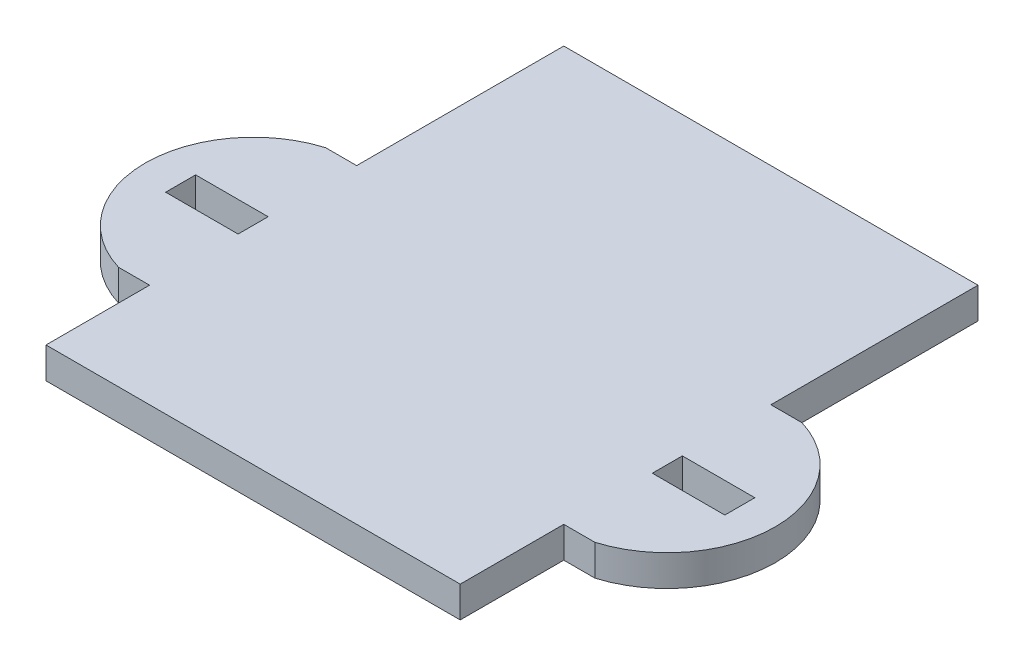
ISO-10303-21;
HEADER;
FILE_DESCRIPTION(('STEP AP214'),'2;1');
FILE_NAME('part.step','',(''),(''),'','','');
FILE_SCHEMA(('AUTOMOTIVE_DESIGN { 1 0 10303 214 1 1 1 1 }'));
ENDSEC;
DATA;
#1=APPLICATION_CONTEXT('core data for automotive mechanical design processes');
#2=APPLICATION_PROTOCOL_DEFINITION('international standard','automotive_design',2000,#1);
#3=PRODUCT_CONTEXT('',#1,'mechanical');
#4=PRODUCT('Part','Part','',(#3));
#5=PRODUCT_RELATED_PRODUCT_CATEGORY('part','',(#4));
#6=PRODUCT_DEFINITION_FORMATION('','',#4);
#7=PRODUCT_DEFINITION_CONTEXT('part definition',#1,'design');
#8=PRODUCT_DEFINITION('design','',#6,#7);
#9=PRODUCT_DEFINITION_SHAPE('','',#8);
#10=(LENGTH_UNIT() NAMED_UNIT(*) SI_UNIT(.MILLI.,.METRE.));
#11=(NAMED_UNIT(*) PLANE_ANGLE_UNIT() SI_UNIT($,.RADIAN.));
#12=(NAMED_UNIT(*) SI_UNIT($,.STERADIAN.) SOLID_ANGLE_UNIT());
#13=UNCERTAINTY_MEASURE_WITH_UNIT(LENGTH_MEASURE(1.E-05),#10,'distance_accuracy_value','');
#14=(GEOMETRIC_REPRESENTATION_CONTEXT(3) GLOBAL_UNCERTAINTY_ASSIGNED_CONTEXT((#13)) GLOBAL_UNIT_ASSIGNED_CONTEXT((#10,
#11,#12)) REPRESENTATION_CONTEXT('',''));
#15=CARTESIAN_POINT('',(0.,0.,0.));
#16=DIRECTION('',(0.,0.,1.));
#17=DIRECTION('',(1.,0.,0.));
#18=AXIS2_PLACEMENT_3D('',#15,#16,#17);
#19=CARTESIAN_POINT('',(0.,3.,3.55));
#20=DIRECTION('',(0.,0.,1.));
#21=DIRECTION('',(1.,0.,0.));
#22=AXIS2_PLACEMENT_3D('',#19,#20,#21);
#23=PLANE('',#22);
#24=DIRECTION('',(-1.,0.,0.));
#25=VECTOR('',#24,1.);
#26=CARTESIAN_POINT('',(0.,0.,3.55));
#27=LINE('',#26,#25);
#28=CARTESIAN_POINT('',(27.,0.,3.54999999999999));
#29=VERTEX_POINT('',#28);
#30=CARTESIAN_POINT('',(20.,0.,3.54999999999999));
#31=VERTEX_POINT('',#30);
#32=EDGE_CURVE('E295',#29,#31,#27,.T.);
#33=ORIENTED_EDGE('',*,*,#32,.F.);
#34=DIRECTION('',(0.,-1.,0.));
#35=VECTOR('',#34,1.);
#36=CARTESIAN_POINT('',(27.,3.,3.54999999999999));
#37=LINE('',#36,#35);
#38=CARTESIAN_POINT('',(27.,3.,3.54999999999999));
#39=VERTEX_POINT('',#38);
#40=EDGE_CURVE('E11',#39,#29,#37,.T.);
#41=ORIENTED_EDGE('',*,*,#40,.F.);
#42=DIRECTION('',(-1.,0.,0.));
#43=VECTOR('',#42,1.);
#44=CARTESIAN_POINT('',(0.,3.,3.55));
#45=LINE('',#44,#43);
#46=CARTESIAN_POINT('',(20.,3.,3.54999999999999));
#47=VERTEX_POINT('',#46);
#48=EDGE_CURVE('E194',#39,#47,#45,.T.);
#49=ORIENTED_EDGE('',*,*,#48,.T.);
#50=DIRECTION('',(0.,-1.,0.));
#51=VECTOR('',#50,1.);
#52=CARTESIAN_POINT('',(20.,3.,3.54999999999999));
#53=LINE('',#52,#51);
#54=EDGE_CURVE('E124',#47,#31,#53,.T.);
#55=ORIENTED_EDGE('',*,*,#54,.T.);
#56=EDGE_LOOP('',(#33,#41,#49,#55));
#57=FACE_BOUND('',#56,.T.);
#58=ADVANCED_FACE('F35',(#57),#23,.T.);
#59=CARTESIAN_POINT('',(27.,3.,0.));
#60=DIRECTION('',(1.,0.,0.));
#61=DIRECTION('',(0.,0.,-1.));
#62=AXIS2_PLACEMENT_3D('',#59,#60,#61);
#63=PLANE('',#62);
#64=DIRECTION('',(0.,0.,1.));
#65=VECTOR('',#64,1.);
#66=CARTESIAN_POINT('',(27.,0.,0.));
#67=LINE('',#66,#65);
#68=CARTESIAN_POINT('',(27.,0.,6.44999999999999));
#69=VERTEX_POINT('',#68);
#70=EDGE_CURVE('E199',#29,#69,#67,.T.);
#71=ORIENTED_EDGE('',*,*,#70,.T.);
#72=DIRECTION('',(0.,-1.,0.));
#73=VECTOR('',#72,1.);
#74=CARTESIAN_POINT('',(27.,3.,6.44999999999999));
#75=LINE('',#74,#73);
#76=CARTESIAN_POINT('',(27.,3.,6.44999999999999));
#77=VERTEX_POINT('',#76);
#78=EDGE_CURVE('E45',#77,#69,#75,.T.);
#79=ORIENTED_EDGE('',*,*,#78,.F.);
#80=DIRECTION('',(0.,0.,1.));
#81=VECTOR('',#80,1.);
#82=CARTESIAN_POINT('',(27.,3.,0.));
#83=LINE('',#82,#81);
#84=EDGE_CURVE('E190',#39,#77,#83,.T.);
#85=ORIENTED_EDGE('',*,*,#84,.F.);
#86=ORIENTED_EDGE('',*,*,#40,.T.);
#87=EDGE_LOOP('',(#71,#79,#85,#86));
#88=FACE_BOUND('',#87,.T.);
#89=ADVANCED_FACE('F197',(#88),#63,.F.);
#90=CARTESIAN_POINT('',(0.,3.,6.45));
#91=DIRECTION('',(0.,0.,1.));
#92=DIRECTION('',(1.,0.,0.));
#93=AXIS2_PLACEMENT_3D('',#90,#91,#92);
#94=PLANE('',#93);
#95=DIRECTION('',(-1.,0.,0.));
#96=VECTOR('',#95,1.);
#97=CARTESIAN_POINT('',(0.,0.,6.45));
#98=LINE('',#97,#96);
#99=CARTESIAN_POINT('',(20.,0.,6.44999999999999));
#100=VERTEX_POINT('',#99);
#101=EDGE_CURVE('E298',#69,#100,#98,.T.);
#102=ORIENTED_EDGE('',*,*,#101,.T.);
#103=DIRECTION('',(0.,-1.,0.));
#104=VECTOR('',#103,1.);
#105=CARTESIAN_POINT('',(20.,3.,6.44999999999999));
#106=LINE('',#105,#104);
#107=CARTESIAN_POINT('',(20.,3.,6.44999999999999));
#108=VERTEX_POINT('',#107);
#109=EDGE_CURVE('E189',#108,#100,#106,.T.);
#110=ORIENTED_EDGE('',*,*,#109,.F.);
#111=DIRECTION('',(-1.,0.,0.));
#112=VECTOR('',#111,1.);
#113=CARTESIAN_POINT('',(0.,3.,6.45));
#114=LINE('',#113,#112);
#115=EDGE_CURVE('E183',#77,#108,#114,.T.);
#116=ORIENTED_EDGE('',*,*,#115,.F.);
#117=ORIENTED_EDGE('',*,*,#78,.T.);
#118=EDGE_LOOP('',(#102,#110,#116,#117));
#119=FACE_BOUND('',#118,.T.);
#120=ADVANCED_FACE('F186',(#119),#94,.F.);
#121=CARTESIAN_POINT('',(0.,3.,6.45));
#122=DIRECTION('',(0.,0.,-1.));
#123=DIRECTION('',(-1.,0.,0.));
#124=AXIS2_PLACEMENT_3D('',#121,#122,#123);
#125=PLANE('',#124);
#126=DIRECTION('',(1.,0.,0.));
#127=VECTOR('',#126,1.);
#128=CARTESIAN_POINT('',(0.,0.,6.45));
#129=LINE('',#128,#127);
#130=CARTESIAN_POINT('',(-27.,0.,6.44999999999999));
#131=VERTEX_POINT('',#130);
#132=CARTESIAN_POINT('',(-20.,0.,6.44999999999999));
#133=VERTEX_POINT('',#132);
#134=EDGE_CURVE('E283',#131,#133,#129,.T.);
#135=ORIENTED_EDGE('',*,*,#134,.F.);
#136=DIRECTION('',(0.,-1.,0.));
#137=VECTOR('',#136,1.);
#138=CARTESIAN_POINT('',(-27.,3.,6.44999999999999));
#139=LINE('',#138,#137);
#140=CARTESIAN_POINT('',(-27.,3.,6.44999999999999));
#141=VERTEX_POINT('',#140);
#142=EDGE_CURVE('E210',#141,#131,#139,.T.);
#143=ORIENTED_EDGE('',*,*,#142,.F.);
#144=DIRECTION('',(1.,0.,0.));
#145=VECTOR('',#144,1.);
#146=CARTESIAN_POINT('',(0.,3.,6.45));
#147=LINE('',#146,#145);
#148=CARTESIAN_POINT('',(-20.,3.,6.44999999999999));
#149=VERTEX_POINT('',#148);
#150=EDGE_CURVE('E331',#141,#149,#147,.T.);
#151=ORIENTED_EDGE('',*,*,#150,.T.);
#152=DIRECTION('',(0.,-1.,0.));
#153=VECTOR('',#152,1.);
#154=CARTESIAN_POINT('',(-20.,3.,6.44999999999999));
#155=LINE('',#154,#153);
#156=EDGE_CURVE('E204',#149,#133,#155,.T.);
#157=ORIENTED_EDGE('',*,*,#156,.T.);
#158=EDGE_LOOP('',(#135,#143,#151,#157));
#159=FACE_BOUND('',#158,.T.);
#160=ADVANCED_FACE('F372',(#159),#125,.T.);
#161=CARTESIAN_POINT('',(-27.,3.,0.));
#162=DIRECTION('',(1.,0.,0.));
#163=DIRECTION('',(0.,0.,-1.));
#164=AXIS2_PLACEMENT_3D('',#161,#162,#163);
#165=PLANE('',#164);
#166=DIRECTION('',(0.,0.,1.));
#167=VECTOR('',#166,1.);
#168=CARTESIAN_POINT('',(-27.,0.,0.));
#169=LINE('',#168,#167);
#170=CARTESIAN_POINT('',(-27.,0.,3.54999999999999));
#171=VERTEX_POINT('',#170);
#172=EDGE_CURVE('E286',#171,#131,#169,.T.);
#173=ORIENTED_EDGE('',*,*,#172,.F.);
#174=DIRECTION('',(0.,-1.,0.));
#175=VECTOR('',#174,1.);
#176=CARTESIAN_POINT('',(-27.,3.,3.54999999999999));
#177=LINE('',#176,#175);
#178=CARTESIAN_POINT('',(-27.,3.,3.54999999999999));
#179=VERTEX_POINT('',#178);
#180=EDGE_CURVE('E208',#179,#171,#177,.T.);
#181=ORIENTED_EDGE('',*,*,#180,.F.);
#182=DIRECTION('',(0.,0.,1.));
#183=VECTOR('',#182,1.);
#184=CARTESIAN_POINT('',(-27.,3.,0.));
#185=LINE('',#184,#183);
#186=EDGE_CURVE('E334',#179,#141,#185,.T.);
#187=ORIENTED_EDGE('',*,*,#186,.T.);
#188=ORIENTED_EDGE('',*,*,#142,.T.);
#189=EDGE_LOOP('',(#173,#181,#187,#188));
#190=FACE_BOUND('',#189,.T.);
#191=ADVANCED_FACE('F368',(#190),#165,.T.);
#192=CARTESIAN_POINT('',(0.,3.,3.55));
#193=DIRECTION('',(0.,0.,-1.));
#194=DIRECTION('',(-1.,0.,0.));
#195=AXIS2_PLACEMENT_3D('',#192,#193,#194);
#196=PLANE('',#195);
#197=DIRECTION('',(1.,0.,0.));
#198=VECTOR('',#197,1.);
#199=CARTESIAN_POINT('',(0.,0.,3.55));
#200=LINE('',#199,#198);
#201=CARTESIAN_POINT('',(-20.,0.,3.54999999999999));
#202=VERTEX_POINT('',#201);
#203=EDGE_CURVE('E289',#171,#202,#200,.T.);
#204=ORIENTED_EDGE('',*,*,#203,.T.);
#205=DIRECTION('',(0.,-1.,0.));
#206=VECTOR('',#205,1.);
#207=CARTESIAN_POINT('',(-20.,3.,3.54999999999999));
#208=LINE('',#207,#206);
#209=CARTESIAN_POINT('',(-20.,3.,3.54999999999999));
#210=VERTEX_POINT('',#209);
#211=EDGE_CURVE('E206',#210,#202,#208,.T.);
#212=ORIENTED_EDGE('',*,*,#211,.F.);
#213=DIRECTION('',(1.,0.,0.));
#214=VECTOR('',#213,1.);
#215=CARTESIAN_POINT('',(0.,3.,3.55));
#216=LINE('',#215,#214);
#217=EDGE_CURVE('E337',#179,#210,#216,.T.);
#218=ORIENTED_EDGE('',*,*,#217,.F.);
#219=ORIENTED_EDGE('',*,*,#180,.T.);
#220=EDGE_LOOP('',(#204,#212,#218,#219));
#221=FACE_BOUND('',#220,.T.);
#222=ADVANCED_FACE('F365',(#221),#196,.F.);
#223=CARTESIAN_POINT('',(19.9782223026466,3.,5.));
#224=DIRECTION('',(0.,-1.,0.));
#225=DIRECTION('',(0.,0.,-1.));
#226=AXIS2_PLACEMENT_3D('',#223,#224,#225);
#227=CYLINDRICAL_SURFACE('',#226,10.4465851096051);
#228=CARTESIAN_POINT('',(19.9782223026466,0.,5.));
#229=DIRECTION('',(0.,1.,0.));
#230=DIRECTION('',(0.,0.,1.));
#231=AXIS2_PLACEMENT_3D('',#228,#229,#230);
#232=CIRCLE('',#231,10.4465851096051);
#233=CARTESIAN_POINT('',(23.,0.,-5.));
#234=VERTEX_POINT('',#233);
#235=CARTESIAN_POINT('',(23.,0.,15.));
#236=VERTEX_POINT('',#235);
#237=EDGE_CURVE('E251',#234,#236,#232,.F.);
#238=ORIENTED_EDGE('',*,*,#237,.F.);
#239=DIRECTION('',(0.,-1.,0.));
#240=VECTOR('',#239,1.);
#241=CARTESIAN_POINT('',(23.,3.,-5.));
#242=LINE('',#241,#240);
#243=CARTESIAN_POINT('',(23.,3.,-5.));
#244=VERTEX_POINT('',#243);
#245=EDGE_CURVE('E39',#244,#234,#242,.T.);
#246=ORIENTED_EDGE('',*,*,#245,.F.);
#247=CARTESIAN_POINT('',(19.9782223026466,3.,5.));
#248=DIRECTION('',(0.,1.,0.));
#249=DIRECTION('',(0.,0.,1.));
#250=AXIS2_PLACEMENT_3D('',#247,#248,#249);
#251=CIRCLE('',#250,10.4465851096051);
#252=CARTESIAN_POINT('',(23.,3.,15.));
#253=VERTEX_POINT('',#252);
#254=EDGE_CURVE('E300',#244,#253,#251,.F.);
#255=ORIENTED_EDGE('',*,*,#254,.T.);
#256=DIRECTION('',(0.,-1.,0.));
#257=VECTOR('',#256,1.);
#258=CARTESIAN_POINT('',(23.,3.,15.));
#259=LINE('',#258,#257);
#260=EDGE_CURVE('E212',#253,#236,#259,.T.);
#261=ORIENTED_EDGE('',*,*,#260,.T.);
#262=EDGE_LOOP('',(#238,#246,#255,#261));
#263=FACE_BOUND('',#262,.T.);
#264=ADVANCED_FACE('F37',(#263),#227,.T.);
#265=CARTESIAN_POINT('',(0.,3.,-5.00000000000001));
#266=DIRECTION('',(0.,0.,1.));
#267=DIRECTION('',(1.,0.,0.));
#268=AXIS2_PLACEMENT_3D('',#265,#266,#267);
#269=PLANE('',#268);
#270=DIRECTION('',(-1.,0.,0.));
#271=VECTOR('',#270,1.);
#272=CARTESIAN_POINT('',(0.,0.,-5.00000000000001));
#273=LINE('',#272,#271);
#274=CARTESIAN_POINT('',(20.,0.,-5.));
#275=VERTEX_POINT('',#274);
#276=EDGE_CURVE('E243',#234,#275,#273,.T.);
#277=ORIENTED_EDGE('',*,*,#276,.T.);
#278=DIRECTION('',(0.,-1.,0.));
#279=VECTOR('',#278,1.);
#280=CARTESIAN_POINT('',(20.,3.,-5.));
#281=LINE('',#280,#279);
#282=CARTESIAN_POINT('',(20.,3.,-5.));
#283=VERTEX_POINT('',#282);
#284=EDGE_CURVE('E233',#283,#275,#281,.T.);
#285=ORIENTED_EDGE('',*,*,#284,.F.);
#286=DIRECTION('',(-1.,0.,0.));
#287=VECTOR('',#286,1.);
#288=CARTESIAN_POINT('',(0.,3.,-5.00000000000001));
#289=LINE('',#288,#287);
#290=EDGE_CURVE('E244',#244,#283,#289,.T.);
#291=ORIENTED_EDGE('',*,*,#290,.F.);
#292=ORIENTED_EDGE('',*,*,#245,.T.);
#293=EDGE_LOOP('',(#277,#285,#291,#292));
#294=FACE_BOUND('',#293,.T.);
#295=ADVANCED_FACE('F242',(#294),#269,.F.);
#296=CARTESIAN_POINT('',(20.,3.,0.));
#297=DIRECTION('',(-1.,0.,0.));
#298=DIRECTION('',(0.,0.,1.));
#299=AXIS2_PLACEMENT_3D('',#296,#297,#298);
#300=PLANE('',#299);
#301=DIRECTION('',(0.,0.,-1.));
#302=VECTOR('',#301,1.);
#303=CARTESIAN_POINT('',(20.,0.,0.));
#304=LINE('',#303,#302);
#305=CARTESIAN_POINT('',(20.,0.,-25.));
#306=VERTEX_POINT('',#305);
#307=EDGE_CURVE('E254',#275,#306,#304,.T.);
#308=ORIENTED_EDGE('',*,*,#307,.T.);
#309=DIRECTION('',(0.,-1.,0.));
#310=VECTOR('',#309,1.);
#311=CARTESIAN_POINT('',(20.,3.,-25.));
#312=LINE('',#311,#310);
#313=CARTESIAN_POINT('',(20.,3.,-25.));
#314=VERTEX_POINT('',#313);
#315=EDGE_CURVE('E232',#314,#306,#312,.T.);
#316=ORIENTED_EDGE('',*,*,#315,.F.);
#317=DIRECTION('',(0.,0.,-1.));
#318=VECTOR('',#317,1.);
#319=CARTESIAN_POINT('',(20.,3.,0.));
#320=LINE('',#319,#318);
#321=EDGE_CURVE('E304',#283,#314,#320,.T.);
#322=ORIENTED_EDGE('',*,*,#321,.F.);
#323=ORIENTED_EDGE('',*,*,#284,.T.);
#324=EDGE_LOOP('',(#308,#316,#322,#323));
#325=FACE_BOUND('',#324,.T.);
#326=ADVANCED_FACE('F410',(#325),#300,.F.);
#327=CARTESIAN_POINT('',(0.,3.,-25.));
#328=DIRECTION('',(0.,0.,-1.));
#329=DIRECTION('',(-1.,0.,0.));
#330=AXIS2_PLACEMENT_3D('',#327,#328,#329);
#331=PLANE('',#330);
#332=DIRECTION('',(1.,0.,0.));
#333=VECTOR('',#332,1.);
#334=CARTESIAN_POINT('',(0.,0.,-25.));
#335=LINE('',#334,#333);
#336=CARTESIAN_POINT('',(-20.,0.,-25.));
#337=VERTEX_POINT('',#336);
#338=EDGE_CURVE('E260',#337,#306,#335,.T.);
#339=ORIENTED_EDGE('',*,*,#338,.F.);
#340=DIRECTION('',(0.,-1.,0.));
#341=VECTOR('',#340,1.);
#342=CARTESIAN_POINT('',(-20.,3.,-25.));
#343=LINE('',#342,#341);
#344=CARTESIAN_POINT('',(-20.,3.,-25.));
#345=VERTEX_POINT('',#344);
#346=EDGE_CURVE('E230',#345,#337,#343,.T.);
#347=ORIENTED_EDGE('',*,*,#346,.F.);
#348=DIRECTION('',(1.,0.,0.));
#349=VECTOR('',#348,1.);
#350=CARTESIAN_POINT('',(0.,3.,-25.));
#351=LINE('',#350,#349);
#352=EDGE_CURVE('E308',#345,#314,#351,.T.);
#353=ORIENTED_EDGE('',*,*,#352,.T.);
#354=ORIENTED_EDGE('',*,*,#315,.T.);
#355=EDGE_LOOP('',(#339,#347,#353,#354));
#356=FACE_BOUND('',#355,.T.);
#357=ADVANCED_FACE('F406',(#356),#331,.T.);
#358=CARTESIAN_POINT('',(-20.,3.,0.));
#359=DIRECTION('',(-1.,0.,0.));
#360=DIRECTION('',(0.,0.,1.));
#361=AXIS2_PLACEMENT_3D('',#358,#359,#360);
#362=PLANE('',#361);
#363=DIRECTION('',(0.,0.,-1.));
#364=VECTOR('',#363,1.);
#365=CARTESIAN_POINT('',(-20.,0.,0.));
#366=LINE('',#365,#364);
#367=CARTESIAN_POINT('',(-20.,0.,-5.));
#368=VERTEX_POINT('',#367);
#369=EDGE_CURVE('E262',#368,#337,#366,.T.);
#370=ORIENTED_EDGE('',*,*,#369,.F.);
#371=DIRECTION('',(0.,-1.,0.));
#372=VECTOR('',#371,1.);
#373=CARTESIAN_POINT('',(-20.,3.,-5.));
#374=LINE('',#373,#372);
#375=CARTESIAN_POINT('',(-20.,3.,-5.));
#376=VERTEX_POINT('',#375);
#377=EDGE_CURVE('E228',#376,#368,#374,.T.);
#378=ORIENTED_EDGE('',*,*,#377,.F.);
#379=DIRECTION('',(0.,0.,-1.));
#380=VECTOR('',#379,1.);
#381=CARTESIAN_POINT('',(-20.,3.,0.));
#382=LINE('',#381,#380);
#383=EDGE_CURVE('E311',#376,#345,#382,.T.);
#384=ORIENTED_EDGE('',*,*,#383,.T.);
#385=ORIENTED_EDGE('',*,*,#346,.T.);
#386=EDGE_LOOP('',(#370,#378,#384,#385));
#387=FACE_BOUND('',#386,.T.);
#388=ADVANCED_FACE('F402',(#387),#362,.T.);
#389=CARTESIAN_POINT('',(0.,3.,-5.00000000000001));
#390=DIRECTION('',(0.,0.,-1.));
#391=DIRECTION('',(-1.,0.,0.));
#392=AXIS2_PLACEMENT_3D('',#389,#390,#391);
#393=PLANE('',#392);
#394=DIRECTION('',(1.,0.,0.));
#395=VECTOR('',#394,1.);
#396=CARTESIAN_POINT('',(0.,0.,-5.00000000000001));
#397=LINE('',#396,#395);
#398=CARTESIAN_POINT('',(-23.,0.,-5.));
#399=VERTEX_POINT('',#398);
#400=EDGE_CURVE('E265',#399,#368,#397,.T.);
#401=ORIENTED_EDGE('',*,*,#400,.F.);
#402=DIRECTION('',(0.,-1.,0.));
#403=VECTOR('',#402,1.);
#404=CARTESIAN_POINT('',(-23.,3.,-5.));
#405=LINE('',#404,#403);
#406=CARTESIAN_POINT('',(-23.,3.,-5.));
#407=VERTEX_POINT('',#406);
#408=EDGE_CURVE('E226',#407,#399,#405,.T.);
#409=ORIENTED_EDGE('',*,*,#408,.F.);
#410=DIRECTION('',(1.,0.,0.));
#411=VECTOR('',#410,1.);
#412=CARTESIAN_POINT('',(0.,3.,-5.00000000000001));
#413=LINE('',#412,#411);
#414=EDGE_CURVE('E314',#407,#376,#413,.T.);
#415=ORIENTED_EDGE('',*,*,#414,.T.);
#416=ORIENTED_EDGE('',*,*,#377,.T.);
#417=EDGE_LOOP('',(#401,#409,#415,#416));
#418=FACE_BOUND('',#417,.T.);
#419=ADVANCED_FACE('F398',(#418),#393,.T.);
#420=CARTESIAN_POINT('',(-19.9782223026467,3.,5.));
#421=DIRECTION('',(0.,-1.,0.));
#422=DIRECTION('',(0.,0.,-1.));
#423=AXIS2_PLACEMENT_3D('',#420,#421,#422);
#424=CYLINDRICAL_SURFACE('',#423,10.4465851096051);
#425=CARTESIAN_POINT('',(-19.9782223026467,0.,5.));
#426=DIRECTION('',(0.,1.,0.));
#427=DIRECTION('',(0.,0.,1.));
#428=AXIS2_PLACEMENT_3D('',#425,#426,#427);
#429=CIRCLE('',#428,10.4465851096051);
#430=CARTESIAN_POINT('',(-23.,0.,15.));
#431=VERTEX_POINT('',#430);
#432=EDGE_CURVE('E268',#399,#431,#429,.T.);
#433=ORIENTED_EDGE('',*,*,#432,.T.);
#434=DIRECTION('',(0.,-1.,0.));
#435=VECTOR('',#434,1.);
#436=CARTESIAN_POINT('',(-23.,3.,15.));
#437=LINE('',#436,#435);
#438=CARTESIAN_POINT('',(-23.,3.,15.));
#439=VERTEX_POINT('',#438);
#440=EDGE_CURVE('E223',#439,#431,#437,.T.);
#441=ORIENTED_EDGE('',*,*,#440,.F.);
#442=CARTESIAN_POINT('',(-19.9782223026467,3.,5.));
#443=DIRECTION('',(0.,1.,0.));
#444=DIRECTION('',(0.,0.,1.));
#445=AXIS2_PLACEMENT_3D('',#442,#443,#444);
#446=CIRCLE('',#445,10.4465851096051);
#447=EDGE_CURVE('E317',#407,#439,#446,.T.);
#448=ORIENTED_EDGE('',*,*,#447,.F.);
#449=ORIENTED_EDGE('',*,*,#408,.T.);
#450=EDGE_LOOP('',(#433,#441,#448,#449));
#451=FACE_BOUND('',#450,.T.);
#452=ADVANCED_FACE('F394',(#451),#424,.T.);
#453=CARTESIAN_POINT('',(0.,3.,15.));
#454=DIRECTION('',(0.,0.,-1.));
#455=DIRECTION('',(-1.,0.,0.));
#456=AXIS2_PLACEMENT_3D('',#453,#454,#455);
#457=PLANE('',#456);
#458=DIRECTION('',(1.,0.,0.));
#459=VECTOR('',#458,1.);
#460=CARTESIAN_POINT('',(0.,0.,15.));
#461=LINE('',#460,#459);
#462=CARTESIAN_POINT('',(-20.,0.,15.));
#463=VERTEX_POINT('',#462);
#464=EDGE_CURVE('E270',#431,#463,#461,.T.);
#465=ORIENTED_EDGE('',*,*,#464,.T.);
#466=DIRECTION('',(0.,-1.,0.));
#467=VECTOR('',#466,1.);
#468=CARTESIAN_POINT('',(-20.,3.,15.));
#469=LINE('',#468,#467);
#470=CARTESIAN_POINT('',(-20.,3.,15.));
#471=VERTEX_POINT('',#470);
#472=EDGE_CURVE('E221',#471,#463,#469,.T.);
#473=ORIENTED_EDGE('',*,*,#472,.F.);
#474=DIRECTION('',(1.,0.,0.));
#475=VECTOR('',#474,1.);
#476=CARTESIAN_POINT('',(0.,3.,15.));
#477=LINE('',#476,#475);
#478=EDGE_CURVE('E319',#439,#471,#477,.T.);
#479=ORIENTED_EDGE('',*,*,#478,.F.);
#480=ORIENTED_EDGE('',*,*,#440,.T.);
#481=EDGE_LOOP('',(#465,#473,#479,#480));
#482=FACE_BOUND('',#481,.T.);
#483=ADVANCED_FACE('F390',(#482),#457,.F.);
#484=CARTESIAN_POINT('',(-20.,3.,0.));
#485=DIRECTION('',(-1.,0.,0.));
#486=DIRECTION('',(0.,0.,1.));
#487=AXIS2_PLACEMENT_3D('',#484,#485,#486);
#488=PLANE('',#487);
#489=DIRECTION('',(0.,0.,-1.));
#490=VECTOR('',#489,1.);
#491=CARTESIAN_POINT('',(-20.,0.,0.));
#492=LINE('',#491,#490);
#493=CARTESIAN_POINT('',(-20.,0.,25.));
#494=VERTEX_POINT('',#493);
#495=EDGE_CURVE('E273',#494,#463,#492,.T.);
#496=ORIENTED_EDGE('',*,*,#495,.F.);
#497=DIRECTION('',(0.,-1.,0.));
#498=VECTOR('',#497,1.);
#499=CARTESIAN_POINT('',(-20.,3.,25.));
#500=LINE('',#499,#498);
#501=CARTESIAN_POINT('',(-20.,3.,25.));
#502=VERTEX_POINT('',#501);
#503=EDGE_CURVE('E219',#502,#494,#500,.T.);
#504=ORIENTED_EDGE('',*,*,#503,.F.);
#505=DIRECTION('',(0.,0.,-1.));
#506=VECTOR('',#505,1.);
#507=CARTESIAN_POINT('',(-20.,3.,0.));
#508=LINE('',#507,#506);
#509=EDGE_CURVE('E321',#502,#471,#508,.T.);
#510=ORIENTED_EDGE('',*,*,#509,.T.);
#511=ORIENTED_EDGE('',*,*,#472,.T.);
#512=EDGE_LOOP('',(#496,#504,#510,#511));
#513=FACE_BOUND('',#512,.T.);
#514=ADVANCED_FACE('F386',(#513),#488,.T.);
#515=CARTESIAN_POINT('',(0.,3.,25.));
#516=DIRECTION('',(0.,0.,-1.));
#517=DIRECTION('',(-1.,0.,0.));
#518=AXIS2_PLACEMENT_3D('',#515,#516,#517);
#519=PLANE('',#518);
#520=DIRECTION('',(1.,0.,0.));
#521=VECTOR('',#520,1.);
#522=CARTESIAN_POINT('',(0.,0.,25.));
#523=LINE('',#522,#521);
#524=CARTESIAN_POINT('',(20.,0.,25.));
#525=VERTEX_POINT('',#524);
#526=EDGE_CURVE('E276',#494,#525,#523,.T.);
#527=ORIENTED_EDGE('',*,*,#526,.T.);
#528=DIRECTION('',(0.,-1.,0.));
#529=VECTOR('',#528,1.);
#530=CARTESIAN_POINT('',(20.,3.,25.));
#531=LINE('',#530,#529);
#532=CARTESIAN_POINT('',(20.,3.,25.));
#533=VERTEX_POINT('',#532);
#534=EDGE_CURVE('E216',#533,#525,#531,.T.);
#535=ORIENTED_EDGE('',*,*,#534,.F.);
#536=DIRECTION('',(1.,0.,0.));
#537=VECTOR('',#536,1.);
#538=CARTESIAN_POINT('',(0.,3.,25.));
#539=LINE('',#538,#537);
#540=EDGE_CURVE('E324',#502,#533,#539,.T.);
#541=ORIENTED_EDGE('',*,*,#540,.F.);
#542=ORIENTED_EDGE('',*,*,#503,.T.);
#543=EDGE_LOOP('',(#527,#535,#541,#542));
#544=FACE_BOUND('',#543,.T.);
#545=ADVANCED_FACE('F382',(#544),#519,.F.);
#546=CARTESIAN_POINT('',(20.,3.,0.));
#547=DIRECTION('',(-1.,0.,0.));
#548=DIRECTION('',(0.,0.,1.));
#549=AXIS2_PLACEMENT_3D('',#546,#547,#548);
#550=PLANE('',#549);
#551=DIRECTION('',(0.,0.,-1.));
#552=VECTOR('',#551,1.);
#553=CARTESIAN_POINT('',(20.,0.,0.));
#554=LINE('',#553,#552);
#555=CARTESIAN_POINT('',(20.,0.,15.));
#556=VERTEX_POINT('',#555);
#557=EDGE_CURVE('E278',#525,#556,#554,.T.);
#558=ORIENTED_EDGE('',*,*,#557,.T.);
#559=DIRECTION('',(0.,-1.,0.));
#560=VECTOR('',#559,1.);
#561=CARTESIAN_POINT('',(20.,3.,15.));
#562=LINE('',#561,#560);
#563=CARTESIAN_POINT('',(20.,3.,15.));
#564=VERTEX_POINT('',#563);
#565=EDGE_CURVE('E214',#564,#556,#562,.T.);
#566=ORIENTED_EDGE('',*,*,#565,.F.);
#567=DIRECTION('',(0.,0.,-1.));
#568=VECTOR('',#567,1.);
#569=CARTESIAN_POINT('',(20.,3.,0.));
#570=LINE('',#569,#568);
#571=EDGE_CURVE('E326',#533,#564,#570,.T.);
#572=ORIENTED_EDGE('',*,*,#571,.F.);
#573=ORIENTED_EDGE('',*,*,#534,.T.);
#574=EDGE_LOOP('',(#558,#566,#572,#573));
#575=FACE_BOUND('',#574,.T.);
#576=ADVANCED_FACE('F363',(#575),#550,.F.);
#577=CARTESIAN_POINT('',(-20.,3.,0.));
#578=DIRECTION('',(-1.,0.,0.));
#579=DIRECTION('',(0.,0.,1.));
#580=AXIS2_PLACEMENT_3D('',#577,#578,#579);
#581=PLANE('',#580);
#582=DIRECTION('',(0.,0.,-1.));
#583=VECTOR('',#582,1.);
#584=CARTESIAN_POINT('',(-20.,0.,0.));
#585=LINE('',#584,#583);
#586=EDGE_CURVE('E292',#133,#202,#585,.T.);
#587=ORIENTED_EDGE('',*,*,#586,.F.);
#588=ORIENTED_EDGE('',*,*,#156,.F.);
#589=DIRECTION('',(0.,0.,-1.));
#590=VECTOR('',#589,1.);
#591=CARTESIAN_POINT('',(-20.,3.,0.));
#592=LINE('',#591,#590);
#593=EDGE_CURVE('E339',#149,#210,#592,.T.);
#594=ORIENTED_EDGE('',*,*,#593,.T.);
#595=ORIENTED_EDGE('',*,*,#211,.T.);
#596=EDGE_LOOP('',(#587,#588,#594,#595));
#597=FACE_BOUND('',#596,.T.);
#598=ADVANCED_FACE('F359',(#597),#581,.T.);
#599=CARTESIAN_POINT('',(0.,3.,15.));
#600=DIRECTION('',(0.,0.,1.));
#601=DIRECTION('',(1.,0.,0.));
#602=AXIS2_PLACEMENT_3D('',#599,#600,#601);
#603=PLANE('',#602);
#604=DIRECTION('',(-1.,0.,0.));
#605=VECTOR('',#604,1.);
#606=CARTESIAN_POINT('',(0.,0.,15.));
#607=LINE('',#606,#605);
#608=EDGE_CURVE('E281',#236,#556,#607,.T.);
#609=ORIENTED_EDGE('',*,*,#608,.F.);
#610=ORIENTED_EDGE('',*,*,#260,.F.);
#611=DIRECTION('',(-1.,0.,0.));
#612=VECTOR('',#611,1.);
#613=CARTESIAN_POINT('',(0.,3.,15.));
#614=LINE('',#613,#612);
#615=EDGE_CURVE('E328',#253,#564,#614,.T.);
#616=ORIENTED_EDGE('',*,*,#615,.T.);
#617=ORIENTED_EDGE('',*,*,#565,.T.);
#618=EDGE_LOOP('',(#609,#610,#616,#617));
#619=FACE_BOUND('',#618,.T.);
#620=ADVANCED_FACE('F362',(#619),#603,.T.);
#621=CARTESIAN_POINT('',(20.,3.,0.));
#622=DIRECTION('',(-1.,0.,0.));
#623=DIRECTION('',(0.,0.,1.));
#624=AXIS2_PLACEMENT_3D('',#621,#622,#623);
#625=PLANE('',#624);
#626=DIRECTION('',(0.,0.,-1.));
#627=VECTOR('',#626,1.);
#628=CARTESIAN_POINT('',(20.,0.,0.));
#629=LINE('',#628,#627);
#630=EDGE_CURVE('E117',#100,#31,#629,.T.);
#631=ORIENTED_EDGE('',*,*,#630,.T.);
#632=ORIENTED_EDGE('',*,*,#54,.F.);
#633=DIRECTION('',(0.,0.,-1.));
#634=VECTOR('',#633,1.);
#635=CARTESIAN_POINT('',(20.,3.,0.));
#636=LINE('',#635,#634);
#637=EDGE_CURVE('E54',#108,#47,#636,.T.);
#638=ORIENTED_EDGE('',*,*,#637,.F.);
#639=ORIENTED_EDGE('',*,*,#109,.T.);
#640=EDGE_LOOP('',(#631,#632,#638,#639));
#641=FACE_BOUND('',#640,.T.);
#642=ADVANCED_FACE('F347',(#641),#625,.F.);
#643=CARTESIAN_POINT('',(0.,3.,0.));
#644=DIRECTION('',(0.,1.,0.));
#645=DIRECTION('',(0.,0.,1.));
#646=AXIS2_PLACEMENT_3D('',#643,#644,#645);
#647=PLANE('',#646);
#648=ORIENTED_EDGE('',*,*,#254,.F.);
#649=ORIENTED_EDGE('',*,*,#290,.T.);
#650=ORIENTED_EDGE('',*,*,#321,.T.);
#651=ORIENTED_EDGE('',*,*,#352,.F.);
#652=ORIENTED_EDGE('',*,*,#383,.F.);
#653=ORIENTED_EDGE('',*,*,#414,.F.);
#654=ORIENTED_EDGE('',*,*,#447,.T.);
#655=ORIENTED_EDGE('',*,*,#478,.T.);
#656=ORIENTED_EDGE('',*,*,#509,.F.);
#657=ORIENTED_EDGE('',*,*,#540,.T.);
#658=ORIENTED_EDGE('',*,*,#571,.T.);
#659=ORIENTED_EDGE('',*,*,#615,.F.);
#660=EDGE_LOOP('',(#648,#649,#650,#651,#652,#653,#654,#655,#656,#657,#658,#659));
#661=FACE_BOUND('',#660,.T.);
#662=ORIENTED_EDGE('',*,*,#150,.F.);
#663=ORIENTED_EDGE('',*,*,#186,.F.);
#664=ORIENTED_EDGE('',*,*,#217,.T.);
#665=ORIENTED_EDGE('',*,*,#593,.F.);
#666=EDGE_LOOP('',(#662,#663,#664,#665));
#667=FACE_BOUND('',#666,.T.);
#668=ORIENTED_EDGE('',*,*,#48,.F.);
#669=ORIENTED_EDGE('',*,*,#84,.T.);
#670=ORIENTED_EDGE('',*,*,#115,.T.);
#671=ORIENTED_EDGE('',*,*,#637,.T.);
#672=EDGE_LOOP('',(#668,#669,#670,#671));
#673=FACE_BOUND('',#672,.T.);
#674=ADVANCED_FACE('F193',(#661,#667,#673),#647,.T.);
#675=CARTESIAN_POINT('',(0.,0.,0.));
#676=DIRECTION('',(0.,1.,0.));
#677=DIRECTION('',(0.,0.,1.));
#678=AXIS2_PLACEMENT_3D('',#675,#676,#677);
#679=PLANE('',#678);
#680=ORIENTED_EDGE('',*,*,#237,.T.);
#681=ORIENTED_EDGE('',*,*,#608,.T.);
#682=ORIENTED_EDGE('',*,*,#557,.F.);
#683=ORIENTED_EDGE('',*,*,#526,.F.);
#684=ORIENTED_EDGE('',*,*,#495,.T.);
#685=ORIENTED_EDGE('',*,*,#464,.F.);
#686=ORIENTED_EDGE('',*,*,#432,.F.);
#687=ORIENTED_EDGE('',*,*,#400,.T.);
#688=ORIENTED_EDGE('',*,*,#369,.T.);
#689=ORIENTED_EDGE('',*,*,#338,.T.);
#690=ORIENTED_EDGE('',*,*,#307,.F.);
#691=ORIENTED_EDGE('',*,*,#276,.F.);
#692=EDGE_LOOP('',(#680,#681,#682,#683,#684,#685,#686,#687,#688,#689,#690,#691));
#693=FACE_BOUND('',#692,.T.);
#694=ORIENTED_EDGE('',*,*,#134,.T.);
#695=ORIENTED_EDGE('',*,*,#586,.T.);
#696=ORIENTED_EDGE('',*,*,#203,.F.);
#697=ORIENTED_EDGE('',*,*,#172,.T.);
#698=EDGE_LOOP('',(#694,#695,#696,#697));
#699=FACE_BOUND('',#698,.T.);
#700=ORIENTED_EDGE('',*,*,#32,.T.);
#701=ORIENTED_EDGE('',*,*,#630,.F.);
#702=ORIENTED_EDGE('',*,*,#101,.F.);
#703=ORIENTED_EDGE('',*,*,#70,.F.);
#704=EDGE_LOOP('',(#700,#701,#702,#703));
#705=FACE_BOUND('',#704,.T.);
#706=ADVANCED_FACE('F248',(#693,#699,#705),#679,.F.);
#707=CLOSED_SHELL('',(#58,#89,#120,#160,#191,#222,#264,#295,#326,#357,#388,#419,#452,#483,#514,
#545,#576,#598,#620,#642,#674,#706));
#708=MANIFOLD_SOLID_BREP('B2',#707);
#709=ADVANCED_BREP_SHAPE_REPRESENTATION('',(#18,#708),#14);
#710=SHAPE_DEFINITION_REPRESENTATION(#9,#709);
ENDSEC;
END-ISO-10303-21;
